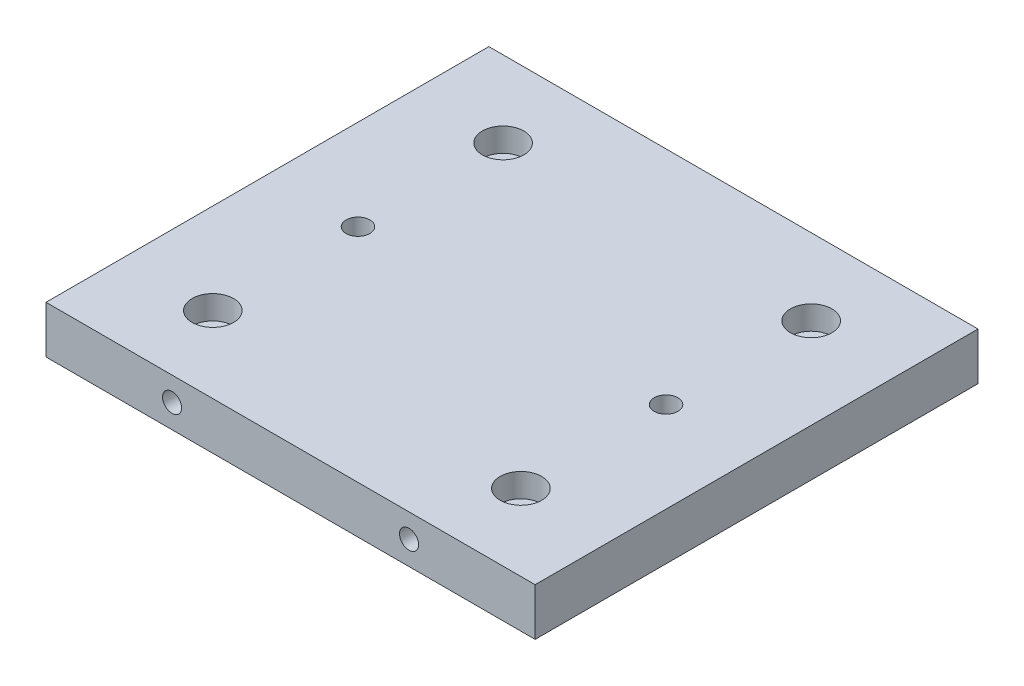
from build123d import *

# Parameters (mm, degrees)
SKETCH1_W                                        = 131.064
SKETCH1_H                                        = 118.6688
BOSS_EXTRUDE1_DEPTH                              = 12.7
CBORE_FOR_1_4_SOCKET_HEAD_CAP_SCREW1_D           = 6.7564
CBORE_FOR_1_4_SOCKET_HEAD_CAP_SCREW1_CBORE_D     = 11.1125
CBORE_FOR_1_4_SOCKET_HEAD_CAP_SCREW1_CBORE_DEPTH = 6.35
F_1_4_0_2500_DOWEL_HOLE1_D                       = 6.35
F_1_4_20_TAPPED_HOLE1_AT_2_COUNT                 = 2
F_1_4_20_TAPPED_HOLE1_AT_2_PITCH                 = 63.5


with BuildPart() as part:
    # Sketch1 → Boss-Extrude1 (new body)
    with BuildSketch(Plane(origin=(0, 0, 0), x_dir=(1, 0, 0), z_dir=(0, 1, 0))):
        Rectangle(SKETCH1_W, SKETCH1_H)
    extrude(amount=BOSS_EXTRUDE1_DEPTH)

    # CBORE for 1_4 Socket Head Cap Screw1 (through all)
    with Locations(Plane(origin=(0, 12.7, 0), x_dir=(1, 0, 0), z_dir=(0, 1, 0))):
        with Locations((41.275, -38.8874), (41.275, 38.8874), (-41.275, -38.8874), (-41.275, 38.8874)):
            CounterBoreHole(CBORE_FOR_1_4_SOCKET_HEAD_CAP_SCREW1_D / 2, CBORE_FOR_1_4_SOCKET_HEAD_CAP_SCREW1_CBORE_D / 2, CBORE_FOR_1_4_SOCKET_HEAD_CAP_SCREW1_CBORE_DEPTH)

    # 1_4 _0.2500_ Dowel Hole1 (through all)
    with Locations(Plane(origin=(0, 0, 0), x_dir=(-1, 0, 0), z_dir=(0, -1, 0))):
        with Locations((-41.275, 0), (41.275, 0)):
            Hole(F_1_4_0_2500_DOWEL_HOLE1_D / 2)

    # Sketch7 → 1_4-20 Tapped Hole1 (revolve, cut)
    with BuildSketch(Plane(origin=(-31.75, 6.35, -59.3344), x_dir=(0, 1, 0), z_dir=(1, 0, 0))):
        Polygon((0, 0), (0, 18.043816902), (2.5527, 16.51), (2.5527, 0), align=None)
    f_1_4_20_tapped_hole1 = revolve(axis=Axis((-31.75, 6.35, -65.6844), (0, 0, 1)), mode=Mode.SUBTRACT)

    # 1_4-20 Tapped Hole1 at 2: 1_4-20 Tapped Hole1 ×2
    with Locations(*[(i * F_1_4_20_TAPPED_HOLE1_AT_2_PITCH, 0, 0) for i in range(1, F_1_4_20_TAPPED_HOLE1_AT_2_COUNT)]):
        add(f_1_4_20_tapped_hole1, mode=Mode.SUBTRACT)

    # Mirror1: 1_4-20 Tapped Hole1 across plane
    add(f_1_4_20_tapped_hole1.mirror(Plane.XY), mode=Mode.SUBTRACT)

    # Mirror1 copy 1 sketch → Mirror1 copy 1 (revolve, cut)
    with BuildSketch(Plane(origin=(31.75, 6.35, 59.3344), x_dir=(0, 1, 0), z_dir=(1, 0, 0))):
        Polygon((0, 0), (0, -18.043816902), (2.5527, -16.51), (2.5527, 0), align=None)
    revolve(axis=Axis((31.75, 6.35, 65.6844), (0, 0, 1)), mode=Mode.SUBTRACT)


solid = part.part
